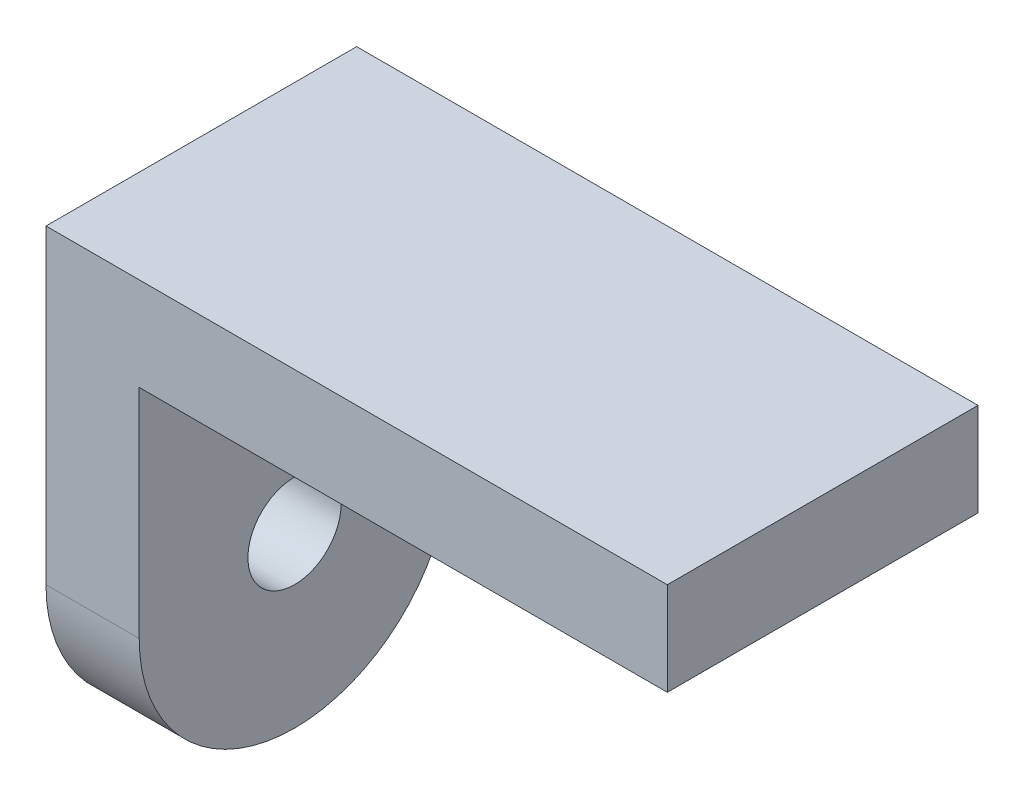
ISO-10303-21;
HEADER;
FILE_DESCRIPTION(('STEP AP214'),'2;1');
FILE_NAME('part.step','',(''),(''),'','','');
FILE_SCHEMA(('AUTOMOTIVE_DESIGN { 1 0 10303 214 1 1 1 1 }'));
ENDSEC;
DATA;
#1=APPLICATION_CONTEXT('core data for automotive mechanical design processes');
#2=APPLICATION_PROTOCOL_DEFINITION('international standard','automotive_design',2000,#1);
#3=PRODUCT_CONTEXT('',#1,'mechanical');
#4=PRODUCT('Part','Part','',(#3));
#5=PRODUCT_RELATED_PRODUCT_CATEGORY('part','',(#4));
#6=PRODUCT_DEFINITION_FORMATION('','',#4);
#7=PRODUCT_DEFINITION_CONTEXT('part definition',#1,'design');
#8=PRODUCT_DEFINITION('design','',#6,#7);
#9=PRODUCT_DEFINITION_SHAPE('','',#8);
#10=(LENGTH_UNIT() NAMED_UNIT(*) SI_UNIT(.MILLI.,.METRE.));
#11=(NAMED_UNIT(*) PLANE_ANGLE_UNIT() SI_UNIT($,.RADIAN.));
#12=(NAMED_UNIT(*) SI_UNIT($,.STERADIAN.) SOLID_ANGLE_UNIT());
#13=UNCERTAINTY_MEASURE_WITH_UNIT(LENGTH_MEASURE(1.E-05),#10,'distance_accuracy_value','');
#14=(GEOMETRIC_REPRESENTATION_CONTEXT(3) GLOBAL_UNCERTAINTY_ASSIGNED_CONTEXT((#13)) GLOBAL_UNIT_ASSIGNED_CONTEXT((#10,
#11,#12)) REPRESENTATION_CONTEXT('',''));
#15=CARTESIAN_POINT('',(0.,0.,0.));
#16=DIRECTION('',(0.,0.,1.));
#17=DIRECTION('',(1.,0.,0.));
#18=AXIS2_PLACEMENT_3D('',#15,#16,#17);
#19=CARTESIAN_POINT('',(0.,12.,10.));
#20=DIRECTION('',(0.,1.,0.));
#21=DIRECTION('',(0.,0.,1.));
#22=AXIS2_PLACEMENT_3D('',#19,#20,#21);
#23=PLANE('',#22);
#24=DIRECTION('',(1.,0.,0.));
#25=VECTOR('',#24,1.);
#26=CARTESIAN_POINT('',(0.,12.,0.));
#27=LINE('',#26,#25);
#28=CARTESIAN_POINT('',(3.,12.,0.));
#29=VERTEX_POINT('',#28);
#30=CARTESIAN_POINT('',(20.,12.,0.));
#31=VERTEX_POINT('',#30);
#32=EDGE_CURVE('E108',#29,#31,#27,.T.);
#33=ORIENTED_EDGE('',*,*,#32,.T.);
#34=DIRECTION('',(0.,0.,-1.));
#35=VECTOR('',#34,1.);
#36=CARTESIAN_POINT('',(20.,12.,10.));
#37=LINE('',#36,#35);
#38=CARTESIAN_POINT('',(20.,12.,10.));
#39=VERTEX_POINT('',#38);
#40=EDGE_CURVE('E106',#39,#31,#37,.T.);
#41=ORIENTED_EDGE('',*,*,#40,.F.);
#42=DIRECTION('',(1.,0.,0.));
#43=VECTOR('',#42,1.);
#44=CARTESIAN_POINT('',(0.,12.,10.));
#45=LINE('',#44,#43);
#46=CARTESIAN_POINT('',(3.,12.,10.));
#47=VERTEX_POINT('',#46);
#48=EDGE_CURVE('E90',#47,#39,#45,.T.);
#49=ORIENTED_EDGE('',*,*,#48,.F.);
#50=DIRECTION('',(0.,0.,-1.));
#51=VECTOR('',#50,1.);
#52=CARTESIAN_POINT('',(3.,12.,10.));
#53=LINE('',#52,#51);
#54=EDGE_CURVE('E124',#47,#29,#53,.T.);
#55=ORIENTED_EDGE('',*,*,#54,.T.);
#56=EDGE_LOOP('',(#33,#41,#49,#55));
#57=FACE_BOUND('',#56,.T.);
#58=ADVANCED_FACE('F33',(#57),#23,.F.);
#59=CARTESIAN_POINT('',(20.,15.,10.));
#60=DIRECTION('',(1.,0.,0.));
#61=DIRECTION('',(0.,0.,-1.));
#62=AXIS2_PLACEMENT_3D('',#59,#60,#61);
#63=PLANE('',#62);
#64=DIRECTION('',(0.,-1.,0.));
#65=VECTOR('',#64,1.);
#66=CARTESIAN_POINT('',(20.,15.,0.));
#67=LINE('',#66,#65);
#68=CARTESIAN_POINT('',(20.,15.,0.));
#69=VERTEX_POINT('',#68);
#70=EDGE_CURVE('E126',#69,#31,#67,.T.);
#71=ORIENTED_EDGE('',*,*,#70,.F.);
#72=DIRECTION('',(0.,0.,-1.));
#73=VECTOR('',#72,1.);
#74=CARTESIAN_POINT('',(20.,15.,10.));
#75=LINE('',#74,#73);
#76=CARTESIAN_POINT('',(20.,15.,10.));
#77=VERTEX_POINT('',#76);
#78=EDGE_CURVE('E113',#77,#69,#75,.T.);
#79=ORIENTED_EDGE('',*,*,#78,.F.);
#80=DIRECTION('',(0.,-1.,0.));
#81=VECTOR('',#80,1.);
#82=CARTESIAN_POINT('',(20.,15.,10.));
#83=LINE('',#82,#81);
#84=EDGE_CURVE('E96',#77,#39,#83,.T.);
#85=ORIENTED_EDGE('',*,*,#84,.T.);
#86=ORIENTED_EDGE('',*,*,#40,.T.);
#87=EDGE_LOOP('',(#71,#79,#85,#86));
#88=FACE_BOUND('',#87,.T.);
#89=ADVANCED_FACE('F115',(#88),#63,.T.);
#90=CARTESIAN_POINT('',(0.,15.,10.));
#91=DIRECTION('',(0.,1.,0.));
#92=DIRECTION('',(0.,0.,1.));
#93=AXIS2_PLACEMENT_3D('',#90,#91,#92);
#94=PLANE('',#93);
#95=DIRECTION('',(1.,0.,0.));
#96=VECTOR('',#95,1.);
#97=CARTESIAN_POINT('',(0.,15.,0.));
#98=LINE('',#97,#96);
#99=CARTESIAN_POINT('',(0.,15.,0.));
#100=VERTEX_POINT('',#99);
#101=EDGE_CURVE('E129',#100,#69,#98,.T.);
#102=ORIENTED_EDGE('',*,*,#101,.F.);
#103=DIRECTION('',(0.,0.,-1.));
#104=VECTOR('',#103,1.);
#105=CARTESIAN_POINT('',(0.,15.,10.));
#106=LINE('',#105,#104);
#107=CARTESIAN_POINT('',(0.,15.,10.));
#108=VERTEX_POINT('',#107);
#109=EDGE_CURVE('E136',#108,#100,#106,.T.);
#110=ORIENTED_EDGE('',*,*,#109,.F.);
#111=DIRECTION('',(1.,0.,0.));
#112=VECTOR('',#111,1.);
#113=CARTESIAN_POINT('',(0.,15.,10.));
#114=LINE('',#113,#112);
#115=EDGE_CURVE('E116',#108,#77,#114,.T.);
#116=ORIENTED_EDGE('',*,*,#115,.T.);
#117=ORIENTED_EDGE('',*,*,#78,.T.);
#118=EDGE_LOOP('',(#102,#110,#116,#117));
#119=FACE_BOUND('',#118,.T.);
#120=ADVANCED_FACE('F168',(#119),#94,.T.);
#121=CARTESIAN_POINT('',(0.,0.,10.));
#122=DIRECTION('',(-1.,0.,0.));
#123=DIRECTION('',(0.,0.,1.));
#124=AXIS2_PLACEMENT_3D('',#121,#122,#123);
#125=PLANE('',#124);
#126=CARTESIAN_POINT('',(0.,5.5,5.));
#127=DIRECTION('',(-1.,0.,0.));
#128=DIRECTION('',(0.,0.,1.));
#129=AXIS2_PLACEMENT_3D('',#126,#127,#128);
#130=CIRCLE('',#129,1.5);
#131=CARTESIAN_POINT('',(0.,5.5,6.5));
#132=VERTEX_POINT('',#131);
#133=EDGE_CURVE('E127',#132,#132,#130,.T.);
#134=ORIENTED_EDGE('',*,*,#133,.F.);
#135=EDGE_LOOP('',(#134));
#136=FACE_BOUND('',#135,.T.);
#137=DIRECTION('',(0.,1.,0.));
#138=VECTOR('',#137,1.);
#139=CARTESIAN_POINT('',(0.,0.,0.));
#140=LINE('',#139,#138);
#141=CARTESIAN_POINT('',(0.,5.,0.));
#142=VERTEX_POINT('',#141);
#143=EDGE_CURVE('E132',#142,#100,#140,.T.);
#144=ORIENTED_EDGE('',*,*,#143,.F.);
#145=CARTESIAN_POINT('',(0.,5.,5.));
#146=DIRECTION('',(-1.,0.,0.));
#147=DIRECTION('',(0.,0.,1.));
#148=AXIS2_PLACEMENT_3D('',#145,#146,#147);
#149=CIRCLE('',#148,5.);
#150=CARTESIAN_POINT('',(0.,0.,5.));
#151=VERTEX_POINT('',#150);
#152=EDGE_CURVE('E41',#142,#151,#149,.T.);
#153=ORIENTED_EDGE('',*,*,#152,.T.);
#154=CARTESIAN_POINT('',(0.,5.,5.));
#155=DIRECTION('',(-1.,0.,0.));
#156=DIRECTION('',(0.,0.,1.));
#157=AXIS2_PLACEMENT_3D('',#154,#155,#156);
#158=CIRCLE('',#157,5.);
#159=CARTESIAN_POINT('',(0.,5.,10.));
#160=VERTEX_POINT('',#159);
#161=EDGE_CURVE('E141',#151,#160,#158,.T.);
#162=ORIENTED_EDGE('',*,*,#161,.T.);
#163=DIRECTION('',(0.,1.,0.));
#164=VECTOR('',#163,1.);
#165=CARTESIAN_POINT('',(0.,0.,10.));
#166=LINE('',#165,#164);
#167=EDGE_CURVE('E118',#160,#108,#166,.T.);
#168=ORIENTED_EDGE('',*,*,#167,.T.);
#169=ORIENTED_EDGE('',*,*,#109,.T.);
#170=EDGE_LOOP('',(#144,#153,#162,#168,#169));
#171=FACE_BOUND('',#170,.T.);
#172=ADVANCED_FACE('F151',(#136,#171),#125,.T.);
#173=CARTESIAN_POINT('',(3.,0.,10.));
#174=DIRECTION('',(-1.,0.,0.));
#175=DIRECTION('',(0.,0.,1.));
#176=AXIS2_PLACEMENT_3D('',#173,#174,#175);
#177=PLANE('',#176);
#178=CARTESIAN_POINT('',(3.,5.5,5.));
#179=DIRECTION('',(1.,0.,0.));
#180=DIRECTION('',(0.,0.,-1.));
#181=AXIS2_PLACEMENT_3D('',#178,#179,#180);
#182=CIRCLE('',#181,1.5);
#183=CARTESIAN_POINT('',(3.,5.5,3.5));
#184=VERTEX_POINT('',#183);
#185=EDGE_CURVE('E195',#184,#184,#182,.T.);
#186=ORIENTED_EDGE('',*,*,#185,.F.);
#187=EDGE_LOOP('',(#186));
#188=FACE_BOUND('',#187,.T.);
#189=CARTESIAN_POINT('',(3.,5.,5.));
#190=DIRECTION('',(-1.,0.,0.));
#191=DIRECTION('',(0.,0.,1.));
#192=AXIS2_PLACEMENT_3D('',#189,#190,#191);
#193=CIRCLE('',#192,5.);
#194=CARTESIAN_POINT('',(3.,5.,10.));
#195=VERTEX_POINT('',#194);
#196=CARTESIAN_POINT('',(3.,0.,5.));
#197=VERTEX_POINT('',#196);
#198=EDGE_CURVE('E145',#195,#197,#193,.F.);
#199=ORIENTED_EDGE('',*,*,#198,.T.);
#200=CARTESIAN_POINT('',(3.,5.,5.));
#201=DIRECTION('',(-1.,0.,0.));
#202=DIRECTION('',(0.,0.,1.));
#203=AXIS2_PLACEMENT_3D('',#200,#201,#202);
#204=CIRCLE('',#203,5.);
#205=CARTESIAN_POINT('',(3.,5.,0.));
#206=VERTEX_POINT('',#205);
#207=EDGE_CURVE('E11',#197,#206,#204,.F.);
#208=ORIENTED_EDGE('',*,*,#207,.T.);
#209=DIRECTION('',(0.,1.,0.));
#210=VECTOR('',#209,1.);
#211=CARTESIAN_POINT('',(3.,0.,0.));
#212=LINE('',#211,#210);
#213=EDGE_CURVE('E103',#206,#29,#212,.T.);
#214=ORIENTED_EDGE('',*,*,#213,.T.);
#215=ORIENTED_EDGE('',*,*,#54,.F.);
#216=DIRECTION('',(0.,1.,0.));
#217=VECTOR('',#216,1.);
#218=CARTESIAN_POINT('',(3.,0.,10.));
#219=LINE('',#218,#217);
#220=EDGE_CURVE('E99',#195,#47,#219,.T.);
#221=ORIENTED_EDGE('',*,*,#220,.F.);
#222=EDGE_LOOP('',(#199,#208,#214,#215,#221));
#223=FACE_BOUND('',#222,.T.);
#224=ADVANCED_FACE('F159',(#188,#223),#177,.F.);
#225=CARTESIAN_POINT('',(20.,12.,10.));
#226=DIRECTION('',(0.,0.,-1.));
#227=DIRECTION('',(-1.,0.,0.));
#228=AXIS2_PLACEMENT_3D('',#225,#226,#227);
#229=PLANE('',#228);
#230=ORIENTED_EDGE('',*,*,#167,.F.);
#231=DIRECTION('',(-1.,0.,0.));
#232=VECTOR('',#231,1.);
#233=CARTESIAN_POINT('',(3.,5.,10.));
#234=LINE('',#233,#232);
#235=EDGE_CURVE('E143',#160,#195,#234,.F.);
#236=ORIENTED_EDGE('',*,*,#235,.T.);
#237=ORIENTED_EDGE('',*,*,#220,.T.);
#238=ORIENTED_EDGE('',*,*,#48,.T.);
#239=ORIENTED_EDGE('',*,*,#84,.F.);
#240=ORIENTED_EDGE('',*,*,#115,.F.);
#241=EDGE_LOOP('',(#230,#236,#237,#238,#239,#240));
#242=FACE_BOUND('',#241,.T.);
#243=ADVANCED_FACE('F93',(#242),#229,.F.);
#244=CARTESIAN_POINT('',(20.,12.,0.));
#245=DIRECTION('',(0.,0.,-1.));
#246=DIRECTION('',(-1.,0.,0.));
#247=AXIS2_PLACEMENT_3D('',#244,#245,#246);
#248=PLANE('',#247);
#249=ORIENTED_EDGE('',*,*,#213,.F.);
#250=DIRECTION('',(-1.,0.,0.));
#251=VECTOR('',#250,1.);
#252=CARTESIAN_POINT('',(20.,5.,0.));
#253=LINE('',#252,#251);
#254=EDGE_CURVE('E147',#206,#142,#253,.T.);
#255=ORIENTED_EDGE('',*,*,#254,.T.);
#256=ORIENTED_EDGE('',*,*,#143,.T.);
#257=ORIENTED_EDGE('',*,*,#101,.T.);
#258=ORIENTED_EDGE('',*,*,#70,.T.);
#259=ORIENTED_EDGE('',*,*,#32,.F.);
#260=EDGE_LOOP('',(#249,#255,#256,#257,#258,#259));
#261=FACE_BOUND('',#260,.T.);
#262=ADVANCED_FACE('F158',(#261),#248,.T.);
#263=CARTESIAN_POINT('',(-12.,5.5,5.));
#264=DIRECTION('',(1.,0.,0.));
#265=DIRECTION('',(0.,0.,-1.));
#266=AXIS2_PLACEMENT_3D('',#263,#264,#265);
#267=CYLINDRICAL_SURFACE('',#266,1.5);
#268=ORIENTED_EDGE('',*,*,#133,.T.);
#269=EDGE_LOOP('',(#268));
#270=FACE_BOUND('',#269,.T.);
#271=ORIENTED_EDGE('',*,*,#185,.T.);
#272=EDGE_LOOP('',(#271));
#273=FACE_BOUND('',#272,.T.);
#274=ADVANCED_FACE('F181',(#270,#273),#267,.F.);
#275=CARTESIAN_POINT('',(3.,5.,5.));
#276=DIRECTION('',(1.,0.,0.));
#277=DIRECTION('',(0.,0.,-1.));
#278=AXIS2_PLACEMENT_3D('',#275,#276,#277);
#279=CYLINDRICAL_SURFACE('',#278,5.);
#280=ORIENTED_EDGE('',*,*,#198,.F.);
#281=ORIENTED_EDGE('',*,*,#235,.F.);
#282=ORIENTED_EDGE('',*,*,#161,.F.);
#283=DIRECTION('',(-1.,0.,0.));
#284=VECTOR('',#283,1.);
#285=CARTESIAN_POINT('',(0.,0.,5.));
#286=LINE('',#285,#284);
#287=EDGE_CURVE('E112',#197,#151,#286,.T.);
#288=ORIENTED_EDGE('',*,*,#287,.F.);
#289=EDGE_LOOP('',(#280,#281,#282,#288));
#290=FACE_BOUND('',#289,.T.);
#291=ADVANCED_FACE('F156',(#290),#279,.T.);
#292=CARTESIAN_POINT('',(20.,5.,5.));
#293=DIRECTION('',(-1.,0.,0.));
#294=DIRECTION('',(0.,0.,1.));
#295=AXIS2_PLACEMENT_3D('',#292,#293,#294);
#296=CYLINDRICAL_SURFACE('',#295,5.);
#297=ORIENTED_EDGE('',*,*,#207,.F.);
#298=ORIENTED_EDGE('',*,*,#287,.T.);
#299=ORIENTED_EDGE('',*,*,#152,.F.);
#300=ORIENTED_EDGE('',*,*,#254,.F.);
#301=EDGE_LOOP('',(#297,#298,#299,#300));
#302=FACE_BOUND('',#301,.T.);
#303=ADVANCED_FACE('F35',(#302),#296,.T.);
#304=CLOSED_SHELL('',(#58,#89,#120,#172,#224,#243,#262,#274,#291,#303));
#305=MANIFOLD_SOLID_BREP('B2',#304);
#306=ADVANCED_BREP_SHAPE_REPRESENTATION('',(#18,#305),#14);
#307=SHAPE_DEFINITION_REPRESENTATION(#9,#306);
ENDSEC;
END-ISO-10303-21;
